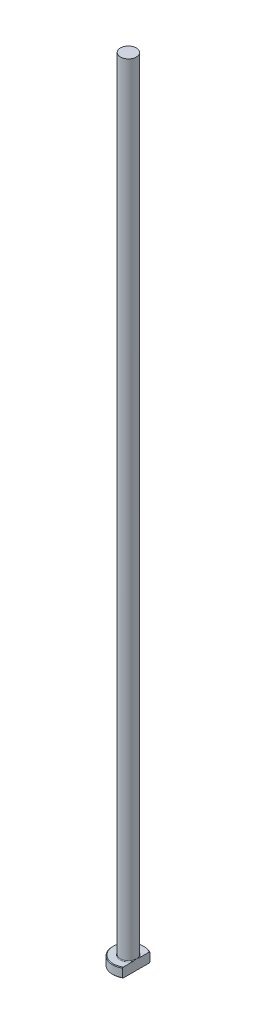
from build123d import *
from build123d.topology import SkipClean

# Parameters (mm, degrees)
CHAMFER1_SIZE = 0.2
FILLET1_R     = 0.2
KEY_DEPTH     = 251.099980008


with BuildPart() as part:
    # Sketch1 → Revolve1 (revolve)
    with BuildSketch(Plane.XY, mode=Mode.PRIVATE) as revolve1_sk:
        Polygon((0, 0), (-5, 0), (-5, 3), (-2.5, 3), (-2.5, 250), (0, 250), align=None)
    revolve(revolve1_sk.sketch.rotate(Axis((0, 259.958771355, 0), (0, -1, 0)), 270), axis=Axis((0, 259.958771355, 0), (0, -1, 0)))

    # Chamfer1
    chamfer1_edges = [part.edges().sort_by_distance(p)[0] for p in [
        (0, 3, -5),
        (0, 0, -5),
    ]]
    chamfer(chamfer1_edges, length=CHAMFER1_SIZE)

    # Fillet1
    fillet1_edges = [part.edges().sort_by_distance(p)[0] for p in [
        (0, 3, -2.5),
    ]]
    fillet(fillet1_edges, radius=FILLET1_R)

    # Sketch2 → KEY (cut, through all)
    with SkipClean():  # the faces are left unmerged after this step: merging them gives an invalid solid
        with BuildSketch(Plane(origin=(0, 0, 0), x_dir=(1, 0, 0), z_dir=(0, 1, 0))):
            with BuildLine():
                Line((2.5, 4.330127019), (2.5, -4.330127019))
                ThreePointArc((2.5, -4.330127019), (5, 0), (2.5, 4.330127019))
            make_face()
        extrude(amount=KEY_DEPTH, mode=Mode.SUBTRACT)


solid = part.part
